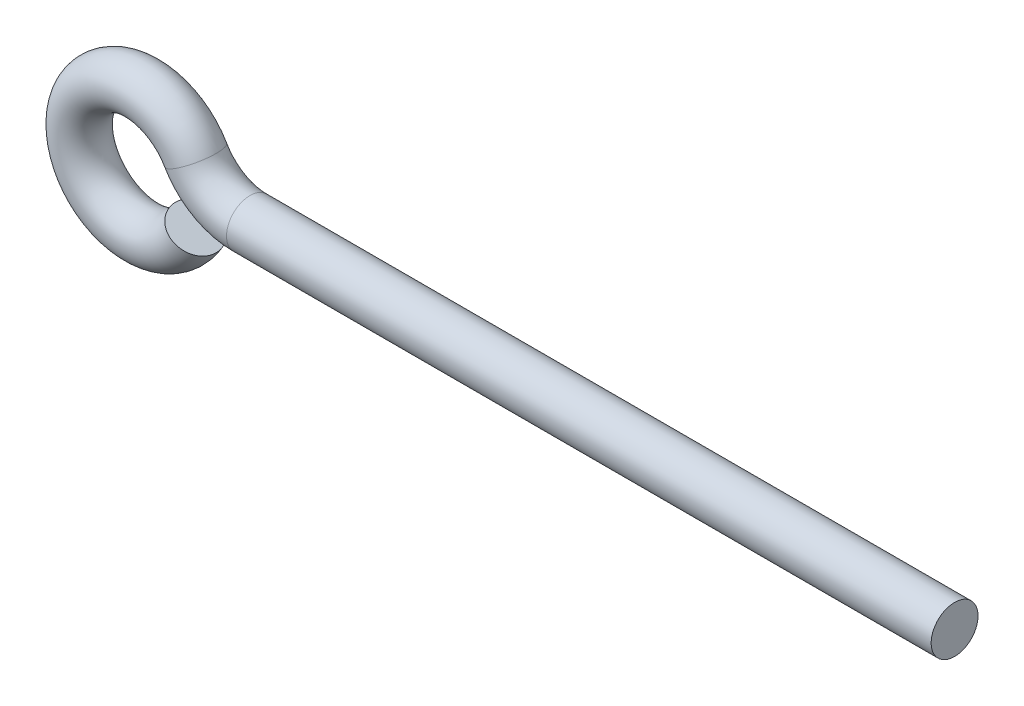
ISO-10303-21;
HEADER;
FILE_DESCRIPTION(('STEP AP214'),'2;1');
FILE_NAME('part.step','',(''),(''),'','','');
FILE_SCHEMA(('AUTOMOTIVE_DESIGN { 1 0 10303 214 1 1 1 1 }'));
ENDSEC;
DATA;
#1=APPLICATION_CONTEXT('core data for automotive mechanical design processes');
#2=APPLICATION_PROTOCOL_DEFINITION('international standard','automotive_design',2000,#1);
#3=PRODUCT_CONTEXT('',#1,'mechanical');
#4=PRODUCT('Part','Part','',(#3));
#5=PRODUCT_RELATED_PRODUCT_CATEGORY('part','',(#4));
#6=PRODUCT_DEFINITION_FORMATION('','',#4);
#7=PRODUCT_DEFINITION_CONTEXT('part definition',#1,'design');
#8=PRODUCT_DEFINITION('design','',#6,#7);
#9=PRODUCT_DEFINITION_SHAPE('','',#8);
#10=(LENGTH_UNIT() NAMED_UNIT(*) SI_UNIT(.MILLI.,.METRE.));
#11=(NAMED_UNIT(*) PLANE_ANGLE_UNIT() SI_UNIT($,.RADIAN.));
#12=(NAMED_UNIT(*) SI_UNIT($,.STERADIAN.) SOLID_ANGLE_UNIT());
#13=UNCERTAINTY_MEASURE_WITH_UNIT(LENGTH_MEASURE(1.E-05),#10,'distance_accuracy_value','');
#14=(GEOMETRIC_REPRESENTATION_CONTEXT(3) GLOBAL_UNCERTAINTY_ASSIGNED_CONTEXT((#13)) GLOBAL_UNIT_ASSIGNED_CONTEXT((#10,
#11,#12)) REPRESENTATION_CONTEXT('',''));
#15=CARTESIAN_POINT('',(0.,0.,0.));
#16=DIRECTION('',(0.,0.,1.));
#17=DIRECTION('',(1.,0.,0.));
#18=AXIS2_PLACEMENT_3D('',#15,#16,#17);
#19=CARTESIAN_POINT('',(-52.,0.,-1.));
#20=DIRECTION('',(0.500000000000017,0.866025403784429,0.));
#21=DIRECTION('',(-0.866025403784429,0.500000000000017,0.));
#22=AXIS2_PLACEMENT_3D('',#19,#20,#21);
#23=PLANE('',#22);
#24=CARTESIAN_POINT('',(-47.2368602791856,-2.75000000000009,0.));
#25=CARTESIAN_POINT('',(-47.2368644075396,-2.74999761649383,0.084192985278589));
#26=CARTESIAN_POINT('',(-47.2430328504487,-2.74643626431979,0.168535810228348));
#27=CARTESIAN_POINT('',(-47.2613878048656,-2.73583902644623,0.29318265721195));
#28=CARTESIAN_POINT('',(-47.2690391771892,-2.7314215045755,0.33447319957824));
#29=CARTESIAN_POINT('',(-47.2873326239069,-2.72085977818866,0.416204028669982));
#30=CARTESIAN_POINT('',(-47.2979771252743,-2.7147141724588,0.456643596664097));
#31=CARTESIAN_POINT('',(-47.3342538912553,-2.69376977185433,0.576047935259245));
#32=CARTESIAN_POINT('',(-47.3642592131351,-2.67644619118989,0.653299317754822));
#33=CARTESIAN_POINT('',(-47.4350904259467,-2.6355517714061,0.800882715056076));
#34=CARTESIAN_POINT('',(-47.4759167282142,-2.61198069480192,0.871214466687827));
#35=CARTESIAN_POINT('',(-47.5443480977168,-2.57247182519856,0.969994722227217));
#36=CARTESIAN_POINT('',(-47.5683752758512,-2.55859972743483,1.00182052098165));
#37=CARTESIAN_POINT('',(-47.6186390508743,-2.52957992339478,1.06299428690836));
#38=CARTESIAN_POINT('',(-47.6448734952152,-2.5144334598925,1.09234461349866));
#39=CARTESIAN_POINT('',(-47.7266780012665,-2.46720360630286,1.17642545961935));
#40=CARTESIAN_POINT('',(-47.7853640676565,-2.43332119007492,1.22720721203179));
#41=CARTESIAN_POINT('',(-47.9092546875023,-2.36179290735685,1.31664307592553));
#42=CARTESIAN_POINT('',(-47.9744589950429,-2.32414718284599,1.35529764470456));
#43=CARTESIAN_POINT('',(-48.1095694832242,-2.24614110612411,1.41942487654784));
#44=CARTESIAN_POINT('',(-48.1794756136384,-2.20578078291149,1.44489768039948));
#45=CARTESIAN_POINT('',(-48.3219976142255,-2.1234956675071,1.481927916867));
#46=CARTESIAN_POINT('',(-48.3946134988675,-2.08157086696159,1.49348527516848));
#47=CARTESIAN_POINT('',(-48.5404949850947,-1.99734615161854,1.50235991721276));
#48=CARTESIAN_POINT('',(-48.6137605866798,-1.955046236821,1.49967720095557));
#49=CARTESIAN_POINT('',(-48.7588633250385,-1.87127113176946,1.48014450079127));
#50=CARTESIAN_POINT('',(-48.8307004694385,-1.82979593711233,1.46329459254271));
#51=CARTESIAN_POINT('',(-48.9708985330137,-1.74885254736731,1.41591564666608));
#52=CARTESIAN_POINT('',(-49.0392594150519,-1.70938437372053,1.38538646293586));
#53=CARTESIAN_POINT('',(-49.1706027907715,-1.63355324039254,1.31147765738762));
#54=CARTESIAN_POINT('',(-49.2335850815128,-1.59719039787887,1.26809755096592));
#55=CARTESIAN_POINT('',(-49.3225880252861,-1.54580452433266,1.19440770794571));
#56=CARTESIAN_POINT('',(-49.3513480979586,-1.52919988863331,1.16840295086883));
#57=CARTESIAN_POINT('',(-49.4069003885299,-1.49712675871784,1.11366646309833));
#58=CARTESIAN_POINT('',(-49.4336906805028,-1.48165937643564,1.08493212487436));
#59=CARTESIAN_POINT('',(-49.5107321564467,-1.43717945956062,0.995001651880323));
#60=CARTESIAN_POINT('',(-49.5577325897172,-1.41004374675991,0.930012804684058));
#61=CARTESIAN_POINT('',(-49.6416016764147,-1.3616219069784,0.791840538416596));
#62=CARTESIAN_POINT('',(-49.6784707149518,-1.34033555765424,0.718657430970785));
#63=CARTESIAN_POINT('',(-49.7254123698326,-1.31323378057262,0.604315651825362));
#64=CARTESIAN_POINT('',(-49.7396779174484,-1.30499756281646,0.565391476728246));
#65=CARTESIAN_POINT('',(-49.7653075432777,-1.29020029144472,0.486332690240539));
#66=CARTESIAN_POINT('',(-49.7766739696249,-1.28363788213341,0.446199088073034));
#67=CARTESIAN_POINT('',(-49.8062700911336,-1.26655055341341,0.32446932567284));
#68=CARTESIAN_POINT('',(-49.8200795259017,-1.25857767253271,0.241341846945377));
#69=CARTESIAN_POINT('',(-49.8301422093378,-1.25276797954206,0.131433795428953));
#70=CARTESIAN_POINT('',(-49.8319385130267,-1.25173088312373,0.105193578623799));
#71=CARTESIAN_POINT('',(-49.8343362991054,-1.25034652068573,0.0526404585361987));
#72=CARTESIAN_POINT('',(-49.8349377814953,-1.24999925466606,0.0263275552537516));
#73=CARTESIAN_POINT('',(-49.834932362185,-1.2500023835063,-0.0841929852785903));
#74=CARTESIAN_POINT('',(-49.8287639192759,-1.25356373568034,-0.168535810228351));
#75=CARTESIAN_POINT('',(-49.810408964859,-1.2641609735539,-0.293182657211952));
#76=CARTESIAN_POINT('',(-49.8027575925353,-1.26857849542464,-0.334473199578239));
#77=CARTESIAN_POINT('',(-49.7844641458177,-1.27914022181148,-0.41620402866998));
#78=CARTESIAN_POINT('',(-49.7738196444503,-1.28528582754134,-0.456643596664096));
#79=CARTESIAN_POINT('',(-49.7375428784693,-1.3062302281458,-0.576047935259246));
#80=CARTESIAN_POINT('',(-49.7075375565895,-1.32355380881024,-0.653299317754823));
#81=CARTESIAN_POINT('',(-49.6367063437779,-1.36444822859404,-0.800882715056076));
#82=CARTESIAN_POINT('',(-49.5958800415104,-1.38801930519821,-0.871214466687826));
#83=CARTESIAN_POINT('',(-49.5274486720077,-1.42752817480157,-0.969994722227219));
#84=CARTESIAN_POINT('',(-49.5034214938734,-1.4414002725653,-1.00182052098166));
#85=CARTESIAN_POINT('',(-49.4531577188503,-1.47042007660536,-1.06299428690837));
#86=CARTESIAN_POINT('',(-49.4269232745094,-1.48556654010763,-1.09234461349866));
#87=CARTESIAN_POINT('',(-49.3451187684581,-1.53279639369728,-1.17642545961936));
#88=CARTESIAN_POINT('',(-49.2864327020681,-1.56667880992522,-1.22720721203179));
#89=CARTESIAN_POINT('',(-49.1625420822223,-1.63820709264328,-1.31664307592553));
#90=CARTESIAN_POINT('',(-49.0973377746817,-1.67585281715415,-1.35529764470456));
#91=CARTESIAN_POINT('',(-48.9622272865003,-1.75385889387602,-1.41942487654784));
#92=CARTESIAN_POINT('',(-48.8923211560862,-1.79421921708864,-1.44489768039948));
#93=CARTESIAN_POINT('',(-48.7497991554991,-1.87650433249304,-1.481927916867));
#94=CARTESIAN_POINT('',(-48.6771832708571,-1.91842913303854,-1.49348527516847));
#95=CARTESIAN_POINT('',(-48.5313017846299,-2.00265384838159,-1.50235991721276));
#96=CARTESIAN_POINT('',(-48.4580361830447,-2.04495376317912,-1.49967720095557));
#97=CARTESIAN_POINT('',(-48.3129334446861,-2.12872886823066,-1.48014450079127));
#98=CARTESIAN_POINT('',(-48.2410963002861,-2.1702040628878,-1.46329459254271));
#99=CARTESIAN_POINT('',(-48.1008982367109,-2.25114745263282,-1.41591564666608));
#100=CARTESIAN_POINT('',(-48.0325373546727,-2.2906156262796,-1.38538646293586));
#101=CARTESIAN_POINT('',(-47.9011939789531,-2.3664467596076,-1.31147765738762));
#102=CARTESIAN_POINT('',(-47.8382116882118,-2.40280960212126,-1.26809755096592));
#103=CARTESIAN_POINT('',(-47.7492087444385,-2.45419547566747,-1.19440770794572));
#104=CARTESIAN_POINT('',(-47.720448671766,-2.47080011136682,-1.16840295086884));
#105=CARTESIAN_POINT('',(-47.6648963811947,-2.50287324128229,-1.11366646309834));
#106=CARTESIAN_POINT('',(-47.6381060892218,-2.51834062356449,-1.08493212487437));
#107=CARTESIAN_POINT('',(-47.5610646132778,-2.56282054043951,-0.995001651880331));
#108=CARTESIAN_POINT('',(-47.5140641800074,-2.58995625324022,-0.930012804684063));
#109=CARTESIAN_POINT('',(-47.4301950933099,-2.63837809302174,-0.791840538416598));
#110=CARTESIAN_POINT('',(-47.3933260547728,-2.6596644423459,-0.718657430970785));
#111=CARTESIAN_POINT('',(-47.346384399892,-2.68676621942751,-0.604315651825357));
#112=CARTESIAN_POINT('',(-47.3321188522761,-2.69500243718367,-0.56539147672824));
#113=CARTESIAN_POINT('',(-47.3064892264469,-2.70979970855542,-0.486332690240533));
#114=CARTESIAN_POINT('',(-47.2951228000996,-2.71636211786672,-0.446199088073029));
#115=CARTESIAN_POINT('',(-47.265526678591,-2.73344944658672,-0.324469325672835));
#116=CARTESIAN_POINT('',(-47.2517172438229,-2.74142232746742,-0.241341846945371));
#117=CARTESIAN_POINT('',(-47.2416545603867,-2.74723202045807,-0.131433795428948));
#118=CARTESIAN_POINT('',(-47.2398582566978,-2.7482691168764,-0.105193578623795));
#119=CARTESIAN_POINT('',(-47.2374604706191,-2.7496534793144,-0.0526404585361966));
#120=CARTESIAN_POINT('',(-47.2368589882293,-2.75000074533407,-0.0263275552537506));
#121=CARTESIAN_POINT('',(-47.2368602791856,-2.75000000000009,0.));
#122=B_SPLINE_CURVE_WITH_KNOTS('',3,(#24,#25,#26,#27,#28,#29,#30,#31,#32,#33,#34,#35,#36,#37,
#38,#39,#40,#41,#42,#43,#44,#45,#46,#47,#48,#49,#50,#51,#52,#53,#54,#55,#56,#57,#58,#59,#60,#61,
#62,#63,#64,#65,#66,#67,#68,#69,#70,#71,#72,#73,#74,#75,#76,#77,#78,#79,#80,#81,#82,#83,#84,#85,
#86,#87,#88,#89,#90,#91,#92,#93,#94,#95,#96,#97,#98,#99,#100,#101,#102,#103,#104,#105,#106,#107,
#108,#109,#110,#111,#112,#113,#114,#115,#116,#117,#118,#119,#120,#121),.UNSPECIFIED.,.T.,.F.,(4,
2,2,2,2,2,2,2,2,2,2,2,2,2,2,2,2,2,2,2,2,2,2,2,2,2,2,2,2,2,2,2,2,2,2,2,2,2,2,2,2,2,2,2,2,2,2,2,
4),(0.,0.252456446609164,0.379016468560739,0.505679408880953,0.75840150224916,1.01113320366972,
1.13766464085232,1.26407408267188,1.51681186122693,1.76954010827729,2.02226565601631,
2.27499255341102,2.52771945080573,2.78044499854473,3.03317324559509,3.28591102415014,
3.41232046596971,3.53885190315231,3.79158360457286,4.04430569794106,4.17096863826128,
4.29752866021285,4.54998510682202,4.62892946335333,4.70787381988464,4.96033026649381,
5.08689028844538,5.2135532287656,5.4662753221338,5.71900702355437,5.84553846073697,
5.97194790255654,6.22468568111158,6.47741392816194,6.73013947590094,6.98286637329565,
7.23559327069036,7.48831881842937,7.74104706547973,7.99378484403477,8.12019428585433,
8.24672572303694,8.49945742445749,8.75217951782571,8.87884245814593,9.0054024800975,
9.25785892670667,9.33680328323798,9.41574763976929),.UNSPECIFIED.);
#123=CARTESIAN_POINT('',(-47.2368602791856,-2.75000000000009,0.));
#124=VERTEX_POINT('',#123);
#125=EDGE_CURVE('E19',#124,#124,#122,.T.);
#126=ORIENTED_EDGE('',*,*,#125,.F.);
#127=EDGE_LOOP('',(#126));
#128=FACE_BOUND('',#127,.T.);
#129=ADVANCED_FACE('F15',(#128),#23,.T.);
#130=CARTESIAN_POINT('',(-52.,0.,0.));
#131=DIRECTION('',(0.,0.,1.));
#132=DIRECTION('',(-0.866025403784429,-0.500000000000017,0.));
#133=AXIS2_PLACEMENT_3D('',#130,#131,#132);
#134=TOROIDAL_SURFACE('',#133,4.,1.5);
#135=ORIENTED_EDGE('',*,*,#125,.T.);
#136=EDGE_LOOP('',(#135));
#137=FACE_BOUND('',#136,.T.);
#138=CARTESIAN_POINT('',(-48.535898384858,2.00000000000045,0.));
#139=DIRECTION('',(-0.499999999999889,0.866025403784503,0.));
#140=DIRECTION('',(-0.866025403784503,-0.499999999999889,0.));
#141=AXIS2_PLACEMENT_3D('',#138,#139,#140);
#142=CIRCLE('',#141,1.5);
#143=CARTESIAN_POINT('',(-49.8349364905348,1.25000000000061,0.));
#144=VERTEX_POINT('',#143);
#145=EDGE_CURVE('E31',#144,#144,#142,.F.);
#146=ORIENTED_EDGE('',*,*,#145,.F.);
#147=EDGE_LOOP('',(#146));
#148=FACE_BOUND('',#147,.T.);
#149=ADVANCED_FACE('F43',(#137,#148),#134,.T.);
#150=CARTESIAN_POINT('',(-45.07179676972,4.,0.));
#151=DIRECTION('',(0.,0.,-1.));
#152=DIRECTION('',(0.,1.,0.));
#153=AXIS2_PLACEMENT_3D('',#150,#151,#152);
#154=TOROIDAL_SURFACE('',#153,4.,1.5);
#155=ORIENTED_EDGE('',*,*,#145,.T.);
#156=EDGE_LOOP('',(#155));
#157=FACE_BOUND('',#156,.T.);
#158=CARTESIAN_POINT('',(-45.07179676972,0.,0.));
#159=DIRECTION('',(-1.,0.,0.));
#160=DIRECTION('',(0.,0.,1.));
#161=AXIS2_PLACEMENT_3D('',#158,#159,#160);
#162=CIRCLE('',#161,1.5);
#163=CARTESIAN_POINT('',(-45.07179676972,0.,1.5));
#164=VERTEX_POINT('',#163);
#165=EDGE_CURVE('E27',#164,#164,#162,.F.);
#166=ORIENTED_EDGE('',*,*,#165,.F.);
#167=EDGE_LOOP('',(#166));
#168=FACE_BOUND('',#167,.T.);
#169=ADVANCED_FACE('F40',(#157,#168),#154,.T.);
#170=CARTESIAN_POINT('',(0.,0.,0.));
#171=DIRECTION('',(-1.,0.,0.));
#172=DIRECTION('',(0.,0.,1.));
#173=AXIS2_PLACEMENT_3D('',#170,#171,#172);
#174=PLANE('',#173);
#175=CARTESIAN_POINT('',(0.,0.,0.));
#176=DIRECTION('',(-1.,0.,0.));
#177=DIRECTION('',(0.,0.,1.));
#178=AXIS2_PLACEMENT_3D('',#175,#176,#177);
#179=CIRCLE('',#178,1.5);
#180=CARTESIAN_POINT('',(0.,0.,1.5));
#181=VERTEX_POINT('',#180);
#182=EDGE_CURVE('E10',#181,#181,#179,.T.);
#183=ORIENTED_EDGE('',*,*,#182,.F.);
#184=EDGE_LOOP('',(#183));
#185=FACE_BOUND('',#184,.T.);
#186=ADVANCED_FACE('F42',(#185),#174,.F.);
#187=CARTESIAN_POINT('',(0.,0.,0.));
#188=DIRECTION('',(-1.,0.,0.));
#189=DIRECTION('',(0.,0.,1.));
#190=AXIS2_PLACEMENT_3D('',#187,#188,#189);
#191=CYLINDRICAL_SURFACE('',#190,1.5);
#192=ORIENTED_EDGE('',*,*,#165,.T.);
#193=EDGE_LOOP('',(#192));
#194=FACE_BOUND('',#193,.T.);
#195=ORIENTED_EDGE('',*,*,#182,.T.);
#196=EDGE_LOOP('',(#195));
#197=FACE_BOUND('',#196,.T.);
#198=ADVANCED_FACE('F17',(#194,#197),#191,.T.);
#199=CLOSED_SHELL('',(#129,#149,#169,#186,#198));
#200=MANIFOLD_SOLID_BREP('B1',#199);
#201=ADVANCED_BREP_SHAPE_REPRESENTATION('',(#18,#200),#14);
#202=SHAPE_DEFINITION_REPRESENTATION(#9,#201);
ENDSEC;
END-ISO-10303-21;
